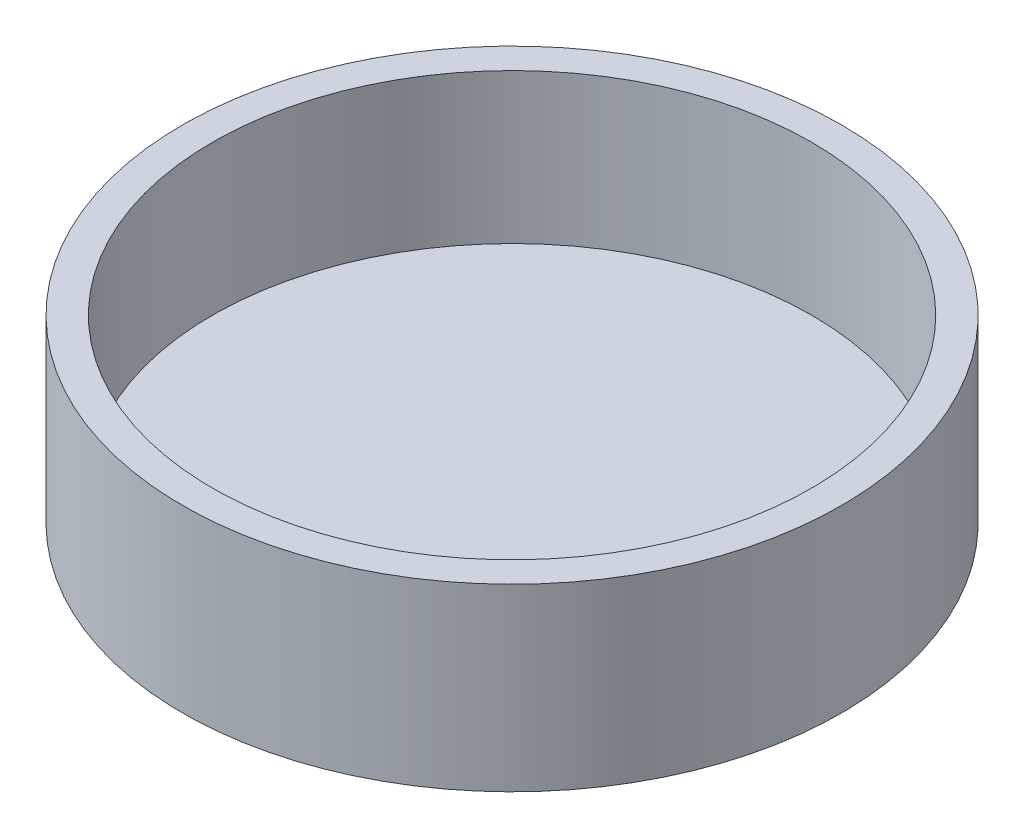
from build123d import *


with BuildPart() as part:
    # Sketch1 → Revolve1 (revolve)
    with BuildSketch(Plane.XY, mode=Mode.PRIVATE) as revolve1_sk:
        Polygon((-139.7, 76.2), (-139.7, 0), (0, 0), (0, 12.7), (-127, 12.7), (-127, 76.2), align=None)
    revolve(revolve1_sk.sketch.rotate(Axis((0, 0, 0), (0, 1, 0)), 270), axis=Axis((0, 0, 0), (0, 1, 0)))


solid = part.part
